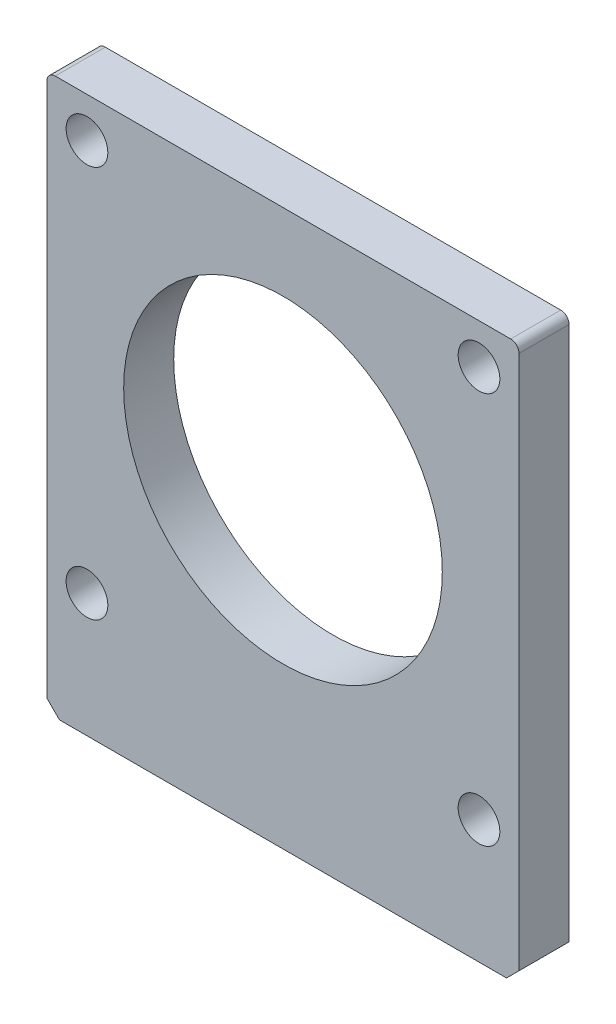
from build123d import *

# Parameters (mm, degrees)
SKETCH1_W           = 56.6
SKETCH1_H           = 56.6
SKETCH1_R           = 19.1
SKETCH1_R_2         = 2.5
BOSS_EXTRUDE1_DEPTH = 6
SKETCH2_W           = 56.6
SKETCH2_H           = 6
BOSS_EXTRUDE2_DEPTH = 10
CHAMFER1_SIZE       = 1.5
FILLET1_R           = 1


with BuildPart() as part:
    # Sketch1 → Boss-Extrude1 (new body)
    with BuildSketch(Plane.XY):
        Rectangle(SKETCH1_W, SKETCH1_H)
        Circle(SKETCH1_R, mode=Mode.SUBTRACT)
        with Locations((-23.5, 23.5)):
            Circle(SKETCH1_R_2, mode=Mode.SUBTRACT)
        with Locations(Location((23.5, 23.5, 0), (0, 0, 180))):
            Circle(SKETCH1_R_2, mode=Mode.SUBTRACT)
        with Locations((23.5, -23.5)):
            Circle(SKETCH1_R_2, mode=Mode.SUBTRACT)
        with Locations(Location((-23.5, -23.5, 0), (0, 0, 180))):
            Circle(SKETCH1_R_2, mode=Mode.SUBTRACT)
    extrude(amount=BOSS_EXTRUDE1_DEPTH)

    # Sketch2 → Boss-Extrude2 (add)
    with BuildSketch(Plane.XZ.offset(28.3)):
        with Locations((0, 3)):
            Rectangle(SKETCH2_W, SKETCH2_H)
    extrude(amount=BOSS_EXTRUDE2_DEPTH)

    # Chamfer1
    chamfer1_edges = [part.edges().sort_by_distance(p)[0] for p in [
        (-28.3, -38.3, 3),
        (28.3, -38.3, 3),
    ]]
    chamfer(chamfer1_edges, length=CHAMFER1_SIZE)

    # Fillet1
    fillet1_edges = [part.edges().sort_by_distance(p)[0] for p in [
        (-28.3, 28.3, 3),
        (28.3, 28.3, 3),
    ]]
    fillet(fillet1_edges, radius=FILLET1_R)


solid = part.part
